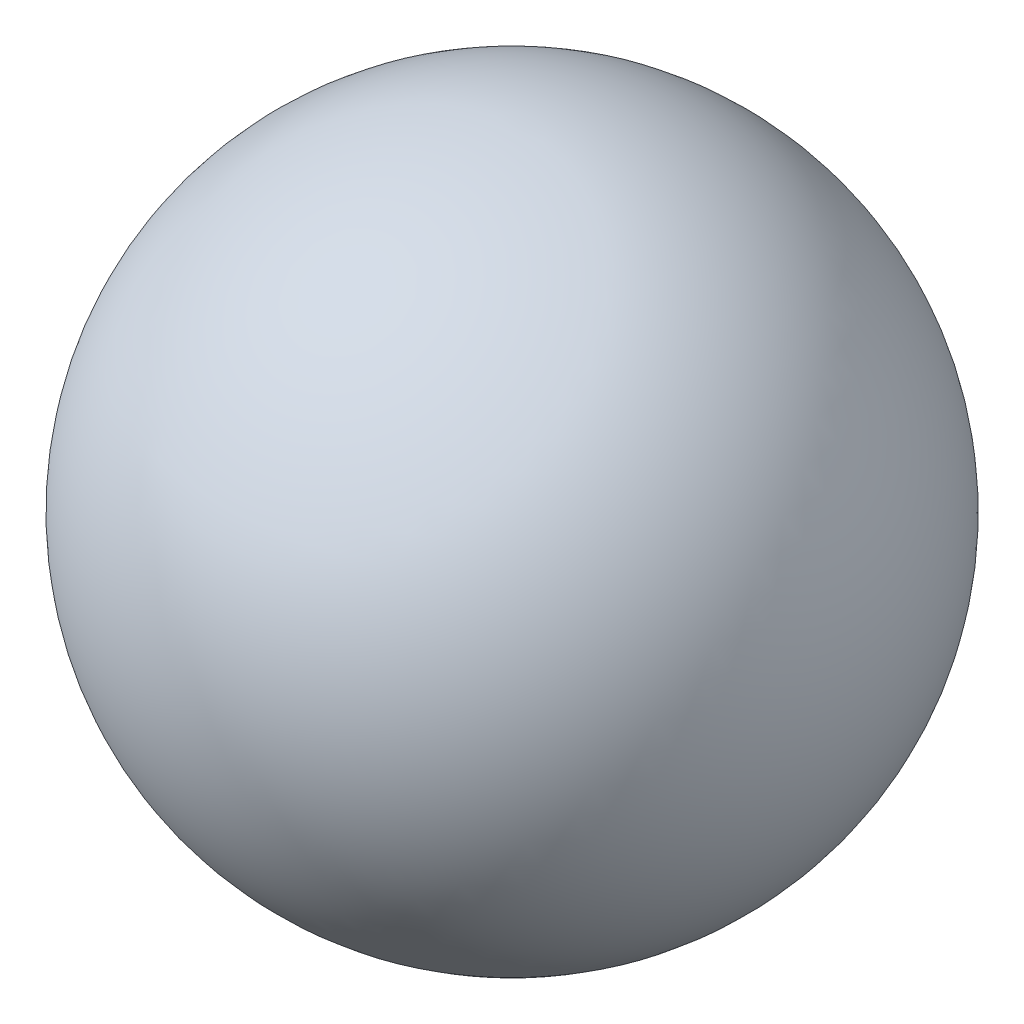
ISO-10303-21;
HEADER;
FILE_DESCRIPTION(('STEP AP214'),'2;1');
FILE_NAME('part.step','',(''),(''),'','','');
FILE_SCHEMA(('AUTOMOTIVE_DESIGN { 1 0 10303 214 1 1 1 1 }'));
ENDSEC;
DATA;
#1=APPLICATION_CONTEXT('core data for automotive mechanical design processes');
#2=APPLICATION_PROTOCOL_DEFINITION('international standard','automotive_design',2000,#1);
#3=PRODUCT_CONTEXT('',#1,'mechanical');
#4=PRODUCT('Part','Part','',(#3));
#5=PRODUCT_RELATED_PRODUCT_CATEGORY('part','',(#4));
#6=PRODUCT_DEFINITION_FORMATION('','',#4);
#7=PRODUCT_DEFINITION_CONTEXT('part definition',#1,'design');
#8=PRODUCT_DEFINITION('design','',#6,#7);
#9=PRODUCT_DEFINITION_SHAPE('','',#8);
#10=(LENGTH_UNIT() NAMED_UNIT(*) SI_UNIT(.MILLI.,.METRE.));
#11=(NAMED_UNIT(*) PLANE_ANGLE_UNIT() SI_UNIT($,.RADIAN.));
#12=(NAMED_UNIT(*) SI_UNIT($,.STERADIAN.) SOLID_ANGLE_UNIT());
#13=UNCERTAINTY_MEASURE_WITH_UNIT(LENGTH_MEASURE(1.E-05),#10,'distance_accuracy_value','');
#14=(GEOMETRIC_REPRESENTATION_CONTEXT(3) GLOBAL_UNCERTAINTY_ASSIGNED_CONTEXT((#13)) GLOBAL_UNIT_ASSIGNED_CONTEXT((#10,
#11,#12)) REPRESENTATION_CONTEXT('',''));
#15=CARTESIAN_POINT('',(0.,0.,0.));
#16=DIRECTION('',(0.,0.,1.));
#17=DIRECTION('',(1.,0.,0.));
#18=AXIS2_PLACEMENT_3D('',#15,#16,#17);
#19=CARTESIAN_POINT('',(0.,0.,0.));
#20=DIRECTION('',(0.,0.,-1.));
#21=DIRECTION('',(1.,0.,0.));
#22=AXIS2_PLACEMENT_3D('',#19,#20,#21);
#23=SPHERICAL_SURFACE('',#22,10.);
#24=CARTESIAN_POINT('',(0.,0.,0.));
#25=DIRECTION('',(0.000442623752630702,0.999999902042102,0.));
#26=DIRECTION('',(-0.999999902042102,0.000442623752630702,0.));
#27=AXIS2_PLACEMENT_3D('',#24,#25,#26);
#28=SPHERICAL_SURFACE('',#27,10.);
#29=CARTESIAN_POINT('',(-0.00383323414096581,-8.66025318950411,0.));
#30=DIRECTION('',(0.000442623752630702,0.999999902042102,0.));
#31=DIRECTION('',(-0.999999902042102,0.000442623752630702,0.));
#32=AXIS2_PLACEMENT_3D('',#29,#30,#31);
#33=CIRCLE('',#32,5.);
#34=CARTESIAN_POINT('',(-5.00383274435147,-8.65804007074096,0.));
#35=VERTEX_POINT('',#34);
#36=EDGE_CURVE('E11',#35,#35,#33,.T.);
#37=ORIENTED_EDGE('',*,*,#36,.T.);
#38=EDGE_LOOP('',(#37));
#39=FACE_BOUND('',#38,.T.);
#40=ADVANCED_FACE('F38',(#39),#28,.T.);
#41=CARTESIAN_POINT('',(-0.00442623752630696,-9.99999902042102,0.));
#42=DIRECTION('',(-0.000442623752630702,-0.999999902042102,0.));
#43=DIRECTION('',(0.999999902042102,-0.000442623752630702,0.));
#44=AXIS2_PLACEMENT_3D('',#41,#42,#43);
#45=CYLINDRICAL_SURFACE('',#44,5.);
#46=CARTESIAN_POINT('',(0.00265574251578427,5.99999941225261,0.));
#47=DIRECTION('',(-0.000442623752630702,-0.999999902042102,0.));
#48=DIRECTION('',(0.999999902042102,-0.000442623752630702,0.));
#49=AXIS2_PLACEMENT_3D('',#46,#47,#48);
#50=CIRCLE('',#49,5.);
#51=CARTESIAN_POINT('',(5.00265525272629,5.99778629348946,0.));
#52=VERTEX_POINT('',#51);
#53=EDGE_CURVE('E44',#52,#52,#50,.T.);
#54=ORIENTED_EDGE('',*,*,#53,.F.);
#55=EDGE_LOOP('',(#54));
#56=FACE_BOUND('',#55,.T.);
#57=ORIENTED_EDGE('',*,*,#36,.F.);
#58=EDGE_LOOP('',(#57));
#59=FACE_BOUND('',#58,.T.);
#60=ADVANCED_FACE('F50',(#56,#59),#45,.F.);
#61=CARTESIAN_POINT('',(0.00265574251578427,5.99999941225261,0.));
#62=DIRECTION('',(-0.000442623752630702,-0.999999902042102,0.));
#63=DIRECTION('',(0.999999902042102,-0.000442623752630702,0.));
#64=AXIS2_PLACEMENT_3D('',#61,#62,#63);
#65=CONICAL_SURFACE('',#64,5.,1.02974425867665);
#66=CARTESIAN_POINT('',(0.00398551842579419,9.0043022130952,0.));
#67=VERTEX_POINT('',#66);
#68=VERTEX_LOOP('',#67);
#69=FACE_BOUND('',#68,.T.);
#70=ORIENTED_EDGE('',*,*,#53,.T.);
#71=EDGE_LOOP('',(#70));
#72=FACE_BOUND('',#71,.T.);
#73=ADVANCED_FACE('F47',(#69,#72),#65,.F.);
#74=CLOSED_SHELL('',(#40,#60,#73));
#75=MANIFOLD_SOLID_BREP('B2',#74);
#76=ADVANCED_BREP_SHAPE_REPRESENTATION('',(#18,#75),#14);
#77=SHAPE_DEFINITION_REPRESENTATION(#9,#76);
ENDSEC;
END-ISO-10303-21;
